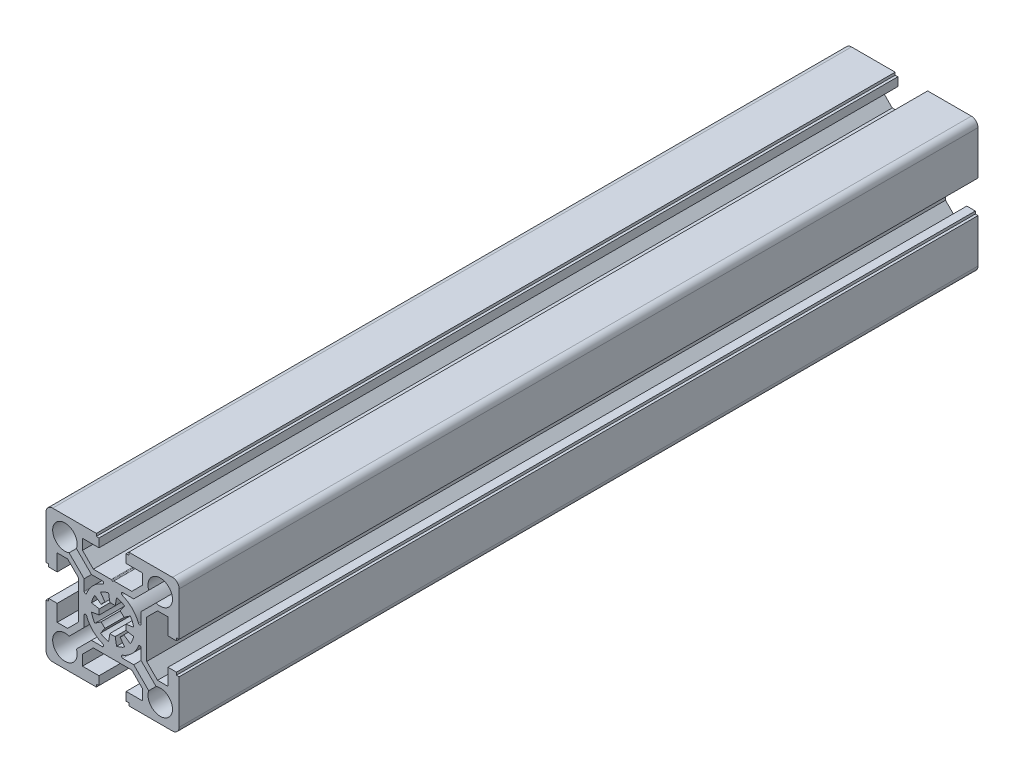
from build123d import *

# Parameters (mm, degrees)
EXTRUDE_1_DEPTH = 300


with BuildPart() as part:
    # Model → Extrude 1 (new body)
    with BuildSketch(Plane.XY):
        with BuildLine():
            Line((4820.227817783, 276.601425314), (4820.227817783, 277.601425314))
            Line((4820.227817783, 277.601425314), (4817.027817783, 277.601425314))
            Line((4817.027817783, 277.601425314), (4817.027817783, 271.401425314))
            Line((4817.027817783, 271.401425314), (4813.113961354, 271.401425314))
            Line((4813.113961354, 271.401425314), (4809.027817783, 275.487568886))
            Line((4809.027817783, 275.487568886), (4809.027817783, 289.915281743))
            Line((4809.027817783, 289.915281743), (4813.113961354, 294.001425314))
            Line((4813.113961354, 294.001425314), (4817.027817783, 294.001425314))
            Line((4817.027817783, 294.001425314), (4817.027817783, 287.801425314))
            Line((4817.027817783, 287.801425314), (4820.227817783, 287.801425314))
            Line((4820.227817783, 287.801425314), (4820.227817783, 288.801425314))
            Line((4820.227817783, 288.801425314), (4821.227817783, 288.801425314))
            Line((4821.227817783, 288.801425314), (4821.227817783, 305.201425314))
            ThreePointArc((4821.227817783, 305.201425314), (4820.495584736, 306.969192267), (4818.727817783, 307.701425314))
            Line((4818.727817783, 307.701425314), (4802.327817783, 307.701425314))
            Line((4802.327817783, 307.701425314), (4802.327817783, 306.701425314))
            Line((4802.327817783, 306.701425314), (4801.327817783, 306.701425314))
            Line((4801.327817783, 306.701425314), (4801.327817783, 303.501425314))
            Line((4801.327817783, 303.501425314), (4807.527817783, 303.501425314))
            Line((4807.527817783, 303.501425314), (4807.527817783, 299.587568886))
            Line((4807.527817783, 299.587568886), (4803.441674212, 295.501425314))
            Line((4803.441674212, 295.501425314), (4796.747433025, 295.501425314))
            ThreePointArc((4796.747433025, 295.501425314), (4796.597433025, 295.461232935), (4796.487625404, 295.351425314))
            ThreePointArc((4796.487625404, 295.351425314), (4796.227817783, 295.201425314), (4795.968010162, 295.351425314))
            ThreePointArc((4795.968010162, 295.351425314), (4795.858202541, 295.461232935), (4795.708202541, 295.501425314))
            Line((4795.708202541, 295.501425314), (4789.013961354, 295.501425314))
            Line((4789.013961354, 295.501425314), (4784.927817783, 299.587568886))
            Line((4784.927817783, 299.587568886), (4784.927817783, 303.501425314))
            Line((4784.927817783, 303.501425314), (4791.127817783, 303.501425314))
            Line((4791.127817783, 303.501425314), (4791.127817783, 306.701425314))
            Line((4791.127817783, 306.701425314), (4790.127817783, 306.701425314))
            Line((4790.127817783, 306.701425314), (4790.127817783, 307.701425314))
            Line((4790.127817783, 307.701425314), (4773.727817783, 307.701425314))
            ThreePointArc((4773.727817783, 307.701425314), (4771.96005083, 306.969192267), (4771.227817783, 305.201425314))
            Line((4771.227817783, 305.201425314), (4771.227817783, 288.801425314))
            Line((4771.227817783, 288.801425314), (4772.227817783, 288.801425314))
            Line((4772.227817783, 288.801425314), (4772.227817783, 287.801425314))
            Line((4772.227817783, 287.801425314), (4775.427817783, 287.801425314))
            Line((4775.427817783, 287.801425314), (4775.427817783, 294.001425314))
            Line((4775.427817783, 294.001425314), (4779.341674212, 294.001425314))
            Line((4779.341674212, 294.001425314), (4783.427817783, 289.915281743))
            Line((4783.427817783, 289.915281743), (4783.427817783, 275.487568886))
            Line((4783.427817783, 275.487568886), (4779.341674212, 271.401425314))
            Line((4779.341674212, 271.401425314), (4775.427817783, 271.401425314))
            Line((4775.427817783, 271.401425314), (4775.427817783, 277.601425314))
            Line((4775.427817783, 277.601425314), (4772.227817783, 277.601425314))
            Line((4772.227817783, 277.601425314), (4772.227817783, 276.601425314))
            Line((4772.227817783, 276.601425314), (4771.227817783, 276.601425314))
            Line((4771.227817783, 276.601425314), (4771.227817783, 260.201425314))
            ThreePointArc((4771.227817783, 260.201425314), (4771.96005083, 258.433658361), (4773.727817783, 257.701425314))
            Line((4773.727817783, 257.701425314), (4790.127817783, 257.701425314))
            Line((4790.127817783, 257.701425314), (4790.127817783, 258.701425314))
            Line((4790.127817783, 258.701425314), (4791.127817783, 258.701425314))
            Line((4791.127817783, 258.701425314), (4791.127817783, 261.901425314))
            Line((4791.127817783, 261.901425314), (4784.927817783, 261.901425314))
            Line((4784.927817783, 261.901425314), (4784.927817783, 265.815281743))
            Line((4784.927817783, 265.815281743), (4789.013961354, 269.901425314))
            Line((4789.013961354, 269.901425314), (4803.441674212, 269.901425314))
            Line((4803.441674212, 269.901425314), (4807.527817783, 265.815281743))
            Line((4807.527817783, 265.815281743), (4807.527817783, 261.901425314))
            Line((4807.527817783, 261.901425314), (4801.327817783, 261.901425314))
            Line((4801.327817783, 261.901425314), (4801.327817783, 258.701425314))
            Line((4801.327817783, 258.701425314), (4802.327817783, 258.701425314))
            Line((4802.327817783, 258.701425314), (4802.327817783, 257.701425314))
            Line((4802.327817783, 257.701425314), (4818.727817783, 257.701425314))
            ThreePointArc((4818.727817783, 257.701425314), (4820.495584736, 258.433658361), (4821.227817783, 260.201425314))
            Line((4821.227817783, 260.201425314), (4821.227817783, 276.601425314))
            Line((4821.227817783, 276.601425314), (4820.227817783, 276.601425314))
        make_face()
        with BuildLine():
            Line((4785.527817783, 278.858249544), (4785.527817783, 274.759141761))
            Line((4785.527817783, 274.759141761), (4779.894931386, 269.126255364))
            ThreePointArc((4779.894931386, 269.126255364), (4775.075126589, 261.548734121), (4782.652647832, 266.368538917))
            Line((4782.652647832, 266.368538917), (4788.28553423, 272.001425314))
            Line((4788.28553423, 272.001425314), (4792.384642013, 272.001425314))
            ThreePointArc((4792.384642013, 272.001425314), (4792.876548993, 272.411828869), (4792.560934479, 272.969315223))
            ThreePointArc((4792.560934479, 272.969315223), (4788.873907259, 275.34751479), (4786.495707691, 279.034542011))
            ThreePointArc((4786.495707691, 279.034542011), (4785.938221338, 279.350156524), (4785.527817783, 278.858249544))
        make_face(mode=Mode.SUBTRACT)
        with BuildLine():
            Line((4792.384642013, 293.401425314), (4788.28553423, 293.401425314))
            Line((4788.28553423, 293.401425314), (4782.652647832, 299.034311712))
            ThreePointArc((4782.652647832, 299.034311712), (4775.075126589, 303.854116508), (4779.894931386, 296.276595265))
            Line((4779.894931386, 296.276595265), (4785.527817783, 290.643708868))
            Line((4785.527817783, 290.643708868), (4785.527817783, 286.544601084))
            ThreePointArc((4785.527817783, 286.544601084), (4785.938221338, 286.052694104), (4786.495707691, 286.368308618))
            ThreePointArc((4786.495707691, 286.368308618), (4788.873907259, 290.055335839), (4792.560934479, 292.433535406))
            ThreePointArc((4792.560934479, 292.433535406), (4792.876548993, 292.991021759), (4792.384642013, 293.401425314))
        make_face(mode=Mode.SUBTRACT)
        with BuildLine():
            Line((4797.727817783, 290.610439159), (4797.227817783, 287.702425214))
            ThreePointArc((4797.227817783, 287.702425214), (4796.227817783, 287.801425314), (4795.227817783, 287.702425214))
            Line((4795.227817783, 287.702425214), (4794.727817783, 290.610439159))
            ThreePointArc((4794.727817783, 290.610439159), (4793.147216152, 290.138655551), (4791.695960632, 289.354602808))
            Line((4791.695960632, 289.354602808), (4793.398683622, 286.944773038))
            ThreePointArc((4793.398683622, 286.944773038), (4792.621573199, 286.307669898), (4791.98447006, 285.530559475))
            Line((4791.98447006, 285.530559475), (4789.574640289, 287.233282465))
            ThreePointArc((4789.574640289, 287.233282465), (4788.790587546, 285.782026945), (4788.318803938, 284.201425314))
            Line((4788.318803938, 284.201425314), (4791.226817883, 283.701425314))
            ThreePointArc((4791.226817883, 283.701425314), (4791.127817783, 282.701425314), (4791.226817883, 281.701425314))
            Line((4791.226817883, 281.701425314), (4788.318803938, 281.201425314))
            ThreePointArc((4788.318803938, 281.201425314), (4788.790587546, 279.620823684), (4789.574640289, 278.169568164))
            Line((4789.574640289, 278.169568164), (4791.98447006, 279.872291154))
            ThreePointArc((4791.98447006, 279.872291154), (4792.621573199, 279.09518073), (4793.398683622, 278.458077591))
            Line((4793.398683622, 278.458077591), (4791.695960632, 276.04824782))
            ThreePointArc((4791.695960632, 276.04824782), (4793.147216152, 275.264195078), (4794.727817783, 274.792411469))
            Line((4794.727817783, 274.792411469), (4795.227817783, 277.700425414))
            ThreePointArc((4795.227817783, 277.700425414), (4796.227817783, 277.601425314), (4797.227817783, 277.700425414))
            Line((4797.227817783, 277.700425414), (4797.727817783, 274.792411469))
            ThreePointArc((4797.727817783, 274.792411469), (4799.308419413, 275.264195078), (4800.759674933, 276.04824782))
            Line((4800.759674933, 276.04824782), (4799.056951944, 278.458077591))
            ThreePointArc((4799.056951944, 278.458077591), (4799.834062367, 279.09518073), (4800.471165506, 279.872291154))
            Line((4800.471165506, 279.872291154), (4802.880995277, 278.169568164))
            ThreePointArc((4802.880995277, 278.169568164), (4803.66504802, 279.620823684), (4804.136831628, 281.201425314))
            Line((4804.136831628, 281.201425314), (4801.228817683, 281.701425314))
            ThreePointArc((4801.228817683, 281.701425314), (4801.327817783, 282.701425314), (4801.228817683, 283.701425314))
            Line((4801.228817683, 283.701425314), (4804.136831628, 284.201425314))
            ThreePointArc((4804.136831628, 284.201425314), (4803.66504802, 285.782026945), (4802.880995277, 287.233282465))
            Line((4802.880995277, 287.233282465), (4800.471165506, 285.530559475))
            ThreePointArc((4800.471165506, 285.530559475), (4799.834062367, 286.307669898), (4799.056951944, 286.944773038))
            Line((4799.056951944, 286.944773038), (4800.759674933, 289.354602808))
            ThreePointArc((4800.759674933, 289.354602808), (4799.308419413, 290.138655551), (4797.727817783, 290.610439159))
        make_face(mode=Mode.SUBTRACT)
        with BuildLine():
            Line((4800.070993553, 272.001425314), (4804.170101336, 272.001425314))
            Line((4804.170101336, 272.001425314), (4809.802987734, 266.368538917))
            ThreePointArc((4809.802987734, 266.368538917), (4817.380508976, 261.548734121), (4812.56070418, 269.126255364))
            Line((4812.56070418, 269.126255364), (4806.927817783, 274.759141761))
            Line((4806.927817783, 274.759141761), (4806.927817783, 278.858249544))
            ThreePointArc((4806.927817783, 278.858249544), (4806.517414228, 279.350156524), (4805.959927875, 279.034542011))
            ThreePointArc((4805.959927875, 279.034542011), (4803.581728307, 275.34751479), (4799.894701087, 272.969315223))
            ThreePointArc((4799.894701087, 272.969315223), (4799.579086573, 272.411828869), (4800.070993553, 272.001425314))
        make_face(mode=Mode.SUBTRACT)
        with BuildLine():
            Line((4804.170101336, 293.401425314), (4800.070993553, 293.401425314))
            ThreePointArc((4800.070993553, 293.401425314), (4799.579086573, 292.991021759), (4799.894701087, 292.433535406))
            ThreePointArc((4799.894701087, 292.433535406), (4803.581728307, 290.055335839), (4805.959927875, 286.368308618))
            ThreePointArc((4805.959927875, 286.368308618), (4806.517414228, 286.052694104), (4806.927817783, 286.544601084))
            Line((4806.927817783, 286.544601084), (4806.927817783, 290.643708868))
            Line((4806.927817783, 290.643708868), (4812.56070418, 296.276595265))
            ThreePointArc((4812.56070418, 296.276595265), (4817.380508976, 303.854116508), (4809.802987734, 299.034311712))
            Line((4809.802987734, 299.034311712), (4804.170101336, 293.401425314))
        make_face(mode=Mode.SUBTRACT)
    extrude(amount=EXTRUDE_1_DEPTH)


solid = part.part
